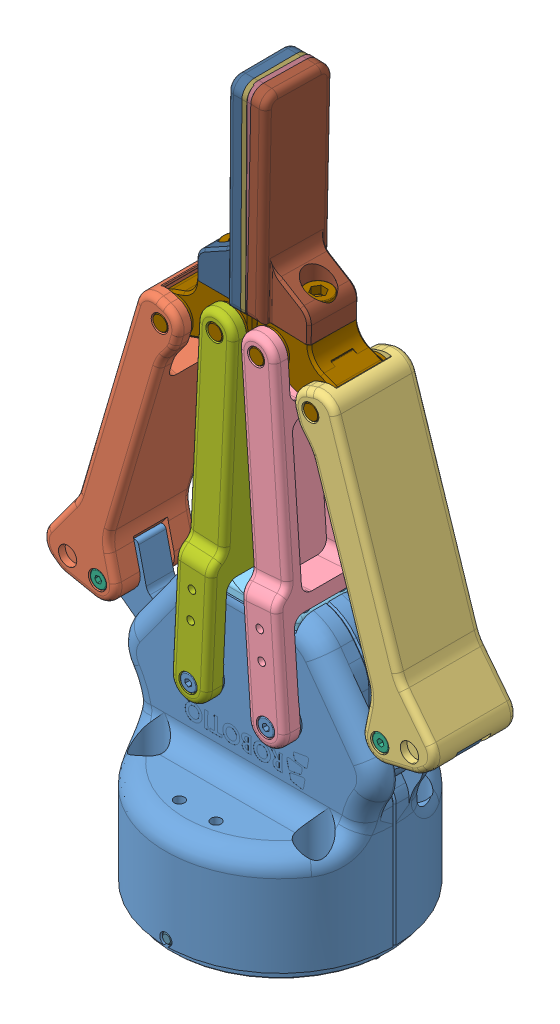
SolidWorks assembly Assem1.sldasm, configuration Varsayılan (file format 9000). Lengths in mm.
Overall size (128.82 237.38 75).
19 component instances, 14 part files, 43 mates.
Components (placement in the parent):
- 17-1: 17.SLDPRT [Varsayılan] at (40.0426 -36.0537 1.5985) size (124.04 94.03 75)
- 02-1: 02.SLDPRT [Varsayılan] at (40.5617 -35.7171 1.5985) x (0.999974 0.007238 0) z (0 0 1) size (44.76 95.6 27.21)
- 04-1: 04.SLDPRT [Varsayılan] at (41.5981 -37.0307 1.5985) x (0.999769 0.021491 0) z (0 0 1) size (44.76 95.6 27.21)
- 11-1: 11.SLDPRT [Varsayılan] at (41.0521 -36.2538 1.5985) x (0.999865 0.016409 0) z (0 0 1) size (17.34 111.86 35.09)
- 10-1: 10.SLDPRT [Varsayılan] at (40.0426 -36.0537 1.5985) size (30.9 8.04 20)
- 08-1: 08.SLDPRT [Varsayılan] at (142.2961 -38.1004 1.6985) size (5.5 5.5 7)
- 08-2: 08.SLDPRT [Varsayılan] at (49.8309 -38.1004 1.6985) size (5.5 5.5 7)
- 08-3: 08.SLDPRT [Varsayılan] at (-78.8199 -21.8664 1.4985) x (-0.968653 0.248417 0) z (0 0 -1) size (5.5 5.5 7)
- 08-4: 08.SLDPRT [Varsayılan] at (67.4918 -55.0067 1.4985) x (-0.902806 -0.430048 0) z (0 0 -1) size (5.5 5.5 7)
- 19-2: 19.SLDPRT [Varsayılan] at (40.3848 -35.9819 1.5985) x (0.999984 0.005575 0) z (0 0 1) size (17.34 111.86 35.09)
- 01-2: 01.SLDPRT [Varsayılan] at (40.0426 -36.0537 1.5985) size (9.22 8.91 16.11)
- 01-3: 01.SLDPRT [Varsayılan] at (2.0426 -36.0537 1.5985) size (9.22 8.91 16.11)
- 03-2: 03.SLDPRT [Varsayılan] at (38.3932 -36.0716 1.5985) x (0.999977 -0.006774 0) z (0 0 1) size (29.9 28.02 27)
- 03-3: 03.SLDPRT [Varsayılan] at (35.0712 -35.9681 1.5985) x (-0.999786 0.020679 0) z (0 0 -1) size (29.9 28.02 27)
- 05-3: 05.SLDPRT [Varsayılan] at (38.3929 -36.0716 1.5099) x (-0.999957 0.006774 0.006394) z (-0.006394 0.000043 -0.99998) size (17.57 65.5 22)
- 13-3: 13.SLDPRT [Varsayılan] at (35.0732 -35.9681 1.3661) x (-0.999646 0.020676 -0.016769) z (0.016765 -0.000347 -0.999859) size (17.57 65.5 22)
- 06-3: 06.SLDPRT [Varsayılan] at (38.3929 -36.0716 1.5099) x (0.999957 -0.006774 -0.006394) z (0.006394 -0.000043 0.99998) size (1.59 65.5 22)
- 07-3: 07.SLDPRT [Varsayılan] at (36.6622 -36.001 1.3927) x (-0.999646 0.020676 -0.016769) z (0.016765 -0.000347 -0.999859) size (1.59 65.5 22)
- 15-1: 15.SLDPRT [Varsayılan] at (38.2115 -35.7063 1.5985) x (0.930531 -0.366214 0) z (0 0 1) size (3.3 3.3 4.06)
Mates (geometry in assembly coordinates):
- Eş Merkezli7: concentric anti-aligned: cylinder of 17-1 through (28.5426 53.5963 7.5985) axis (0 -1 0) radius 1.5; circle of 10-1
- Eş Merkezli8: concentric anti-aligned: cylinder of 17-1 through (51.5426 53.5963 7.5985) axis (0 -1 0) radius 1.5; circle of 10-1
- Çakışık13: coincident aligned: plane of 17-1 through (24.5426 49.9463 -35.9015) normal (0 1 0); plane of 10-1 through (55.4926 49.9463 -8.4015) normal (0 1 0)
- Eş Merkezli9: concentric aligned: cylinder of 17-1 through (52.7426 25.3663 50.7735) axis (0 0 1) radius 1.5; cylinder of 11-1 through (52.7426 25.3663 19.0985) axis (0 0 1) radius 3
- Genişlik5: width aligned: plane of 11-1 through (47.176 18.9622 -10.4515) normal (0 0 1); plane of 11-1 through (47.176 18.9622 13.6485) normal (0 0 -1); plane of 17-1 through (58.2399 25.5385 13.5985) normal (0 0 1); plane of 17-1 through (52.6538 19.867 -10.4015) normal (0 0 -1)
- Eş Merkezli13: concentric anti-aligned: cylinder of 04-1 through (86.2752 35.8277 15.1985) axis (0 0 1) radius 2.5; cylinder of 08-1 through (86.2752 35.8277 -43.5515) axis (0 0 -1) radius 1.5
- Çakışık15: coincident anti-aligned: circle of 04-1; plane of 08-1 through (86.1429 38.5745 -9.8015) normal (0 0 1)
- Eş Merkezli16: concentric aligned: cylinder of 17-1 through (86.2752 35.8277 6.0985) axis (0 0 1) radius 2.5; cylinder of 04-1 through (86.2752 35.8277 15.1985) axis (0 0 1) radius 2.5
- Eş Merkezli21: concentric aligned: cylinder of 17-1 through (-6.19 35.8277 -2.9015) axis (0 0 -1) radius 2.5; cylinder of 02-1 through (-6.19 35.8277 -12.0015) axis (0 0 -1) radius 2.5
- Eş Merkezli23: concentric aligned: cylinder of 17-1 through (-6.19 35.8277 -2.9015) axis (0 0 -1) radius 2.5; cylinder of 02-1 through (-6.19 35.8277 -12.0015) axis (0 0 -1) radius 2.5
- Genişlik6: width anti-aligned: plane of 17-1 through (-1.1205 17.1377 6.0985) normal (0 0 1); plane of 17-1 through (-1.1205 17.1377 -2.9015) normal (0 0 -1); plane of 02-1 through (-7.4282 24.0361 7.1985) normal (0 0 -1); plane of 02-1 through (-7.4282 24.0361 -4.0015) normal (0 0 1)
- Eş Merkezli24: concentric aligned: cylinder of 04-1 through (86.2752 35.8277 15.1985) axis (0 0 1) radius 2.5; cylinder of 08-4 through (86.2752 35.8277 46.7485) axis (0 0 1) radius 1.5
- Çakışık17: coincident anti-aligned: circle of 04-1; plane of 08-4 through (85.2134 38.3645 12.9985) normal (0 0 -1)
- Eş Merkezli25: concentric anti-aligned: cylinder of 02-1 through (-6.19 35.8277 -12.0015) axis (0 0 -1) radius 2.5; cylinder of 08-3 through (-6.19 35.8277 46.7485) axis (0 0 1) radius 1.5
- Çakışık18: coincident anti-aligned: plane of 02-1 through (-4.7066 37.8401 12.9985) normal (0 0 1); circle of 08-3
- Eş Merkezli26: concentric aligned: cylinder of 02-1 through (-6.19 35.8277 -12.0015) axis (0 0 -1) radius 2.5; cylinder of 08-2 through (-6.19 35.8277 -43.5515) axis (0 0 -1) radius 1.5
- Çakışık19: coincident anti-aligned: plane of 02-1 through (-4.7066 37.8401 -9.8015) normal (0 0 -1); circle of 08-2
- Eş Merkezli28: concentric aligned: cylinder of 17-1 through (27.3426 25.3663 -47.5765) axis (0 0 -1) radius 1.5; cylinder of 19-2 through (27.3426 25.3663 -15.9015) axis (0 0 -1) radius 3
- Eş Merkezli29: concentric anti-aligned: cylinder of 17-1 through (59.0426 44.4463 -9.4015) axis (0 0 -1) radius 4.5; cylinder of 01-2 through (59.0426 44.4463 -8.7015) axis (0 0 1) radius 2
- Çakışık20: coincident anti-aligned: plane of 17-1 through (56.9431 44.4463 -6.5015) normal (0 0 -1); plane of 01-2 through (57.2529 41.0942 -6.5015) normal (0 0 1)
- Eş Merkezli30: concentric anti-aligned: circle of 17-1; cylinder of 01-3 through (21.0426 44.4463 -8.7015) axis (0 0 1) radius 2
- Çakışık21: coincident anti-aligned: plane of 17-1 through (18.9431 44.4463 -6.5015) normal (0 0 -1); plane of 01-3 through (19.2529 41.0942 -6.5015) normal (0 0 1)
- Eş Merkezli38: concentric aligned: cylinder of 17-1 through (86.2752 35.8277 6.0985) axis (0 0 1) radius 2.5; cylinder of 04-1 through (86.2752 35.8277 15.1985) axis (0 0 1) radius 2.5
- Genişlik8: width anti-aligned: plane of 04-1 through (87.8516 24.0766 7.1985) normal (0 0 -1); plane of 04-1 through (87.8516 24.0766 -4.0015) normal (0 0 1); plane of 17-1 through (81.2057 17.1377 6.0985) normal (0 0 1); plane of 17-1 through (81.2057 17.1377 -2.9015) normal (0 0 -1)
- Genişlik9: width aligned: plane of 19-2 through (33.0486 19.0861 -10.4515) normal (0 0 1); plane of 19-2 through (33.0486 19.0861 13.6485) normal (0 0 -1); plane of 17-1 through (32.8252 24.9293 13.5985) normal (0 0 1); plane of 17-1 through (30.4143 20.804 -10.4015) normal (0 0 -1)
- Eş Merkezli40: concentric aligned: cone of 19-2 through (32.1273 125.2518 -12.0015) axis (0 0 1); cylinder of 03-2 through (32.1273 125.2518 15.0985) axis (0 0 1) radius 2.5
- Genişlik10: width anti-aligned: plane of 03-2 through (27.3055 122.6061 -7.5015) normal (0 0 -1); plane of 03-2 through (35.568 129.5427 10.6985) normal (0 0 1); plane of 19-2 through (38.4075 130.9578 -7.5015) normal (0 0 1); plane of 19-2 through (38.4075 130.9578 10.6985) normal (0 0 -1)
- Eş Merkezli41: concentric anti-aligned: cone of 02-1 through (14.1825 118.8577 -12.0015) axis (0 0 1); cylinder of 03-2 through (14.1825 118.8577 -11.9015) axis (0 0 -1) radius 2.5
- Eş Merkezli42: concentric anti-aligned: cone of 04-1 through (63.5259 118.2382 15.1985) axis (0 0 -1); cylinder of 03-3 through (63.5259 118.2382 15.0985) axis (0 0 1) radius 2.5
- Genişlik11: width aligned: plane of 03-3 through (68.2733 115.4611 10.6985) normal (0 0 1); plane of 03-3 through (60.2043 122.622 -7.5015) normal (0 0 -1); plane of 04-1 through (115.9757 141.6328 -7.5015) normal (0 0 1); plane of 04-1 through (119.6922 130.2228 10.6985) normal (0 0 -1)
- Eş Merkezli43: concentric anti-aligned: cone of 11-1 through (45.7633 125.1225 -12.0015) axis (0 0 1); cylinder of 03-3 through (45.7633 125.1225 -11.9015) axis (0 0 -1) radius 2.5
- Çakışık34: coincident aligned: plane of 03-2 through (38.1712 131.711 -6.5015) normal (0.006774 0.999977 0); plane of 05-3 through (20.4421 131.8311 12.6321) normal (0.006774 0.999977 0)
- Eş Merkezli44: concentric aligned: cylinder of 03-3 through (53.239 172.228 1.5985) axis (0.020679 0.999786 0) radius 2.5; cylinder of 13-3 through (53.7508 196.9727 1.5985) axis (0.020679 0.999786 0) radius 4.5
- Çakışık37: coincident aligned: plane of 03-3 through (39.899 131.7452 9.6985) normal (0.020679 0.999786 0); plane of 13-3 through (57.8788 131.3733 -9.3111) normal (0.020679 0.999786 0)
- Eş Merkezli47: concentric aligned: cylinder of 03-2 through (25.9476 172.5447 1.5985) axis (0.006774 0.999977 0) radius 2.5; cylinder of 05-3 through (26.1152 197.2942 1.5985) axis (0.006774 0.999977 0) radius 4.5
- Çakışık40: coincident: plane of 05-3 through (37.8706 131.713 -9.4797) normal (0.006394 -0.000043 0.99998); line of 06-3 through (39.4716 133.7022 -9.4899) axis (0.006774 0.999977 0)
- Çakışık42: coincident anti-aligned: plane of 13-3 through (39.9462 131.7442 12.3912) normal (0.016765 -0.000347 -0.999859); plane of 07-3 through (41.218 193.231 12.3912) normal (-0.016765 0.000347 0.999859)
- Çakışık43: coincident: line of 13-3 through (41.218 193.231 12.3912) axis (-0.020679 -0.999786 0); plane of 07-3 through (41.2851 193.2297 8.3917) normal (0.999646 -0.020676 0.016769)
- Çakışık44: coincident anti-aligned: plane of 13-3 through (41.6696 197.2226 -9.6057) normal (-0.020679 -0.999786 0); plane of 07-3 through (41.6025 197.2239 -5.6063) normal (0.020679 0.999786 0)
- Çakışık45: coincident anti-aligned: plane of 17-1 through (41.4426 -31.0537 38.0985) normal (0 0 1); plane of 15-1 through (40.0426 -31.0537 38.0985) normal (0 0 -1)
- Eş Merkezli48: concentric anti-aligned: cylinder of 17-1 through (40.0426 -31.0537 39.0985) axis (0 0 1) radius 2; cylinder of 15-1 through (40.0426 -31.0537 38.0985) axis (0 0 -1) radius 1.4224
- Çakışık46: coincident aligned: plane of 05-3 through (38.0113 131.7121 12.5198) normal (-0.999957 0.006774 0.006394); plane of 06-3 through (38.4023 193.2109 8.5199) normal (-0.999957 0.006774 0.006394)
- Çakışık47: coincident anti-aligned: plane of 05-3 through (38.455 197.2106 12.5198) normal (-0.006774 -0.999977 0); plane of 06-3 through (39.9274 197.2006 -5.49) normal (0.006774 0.999977 0)
